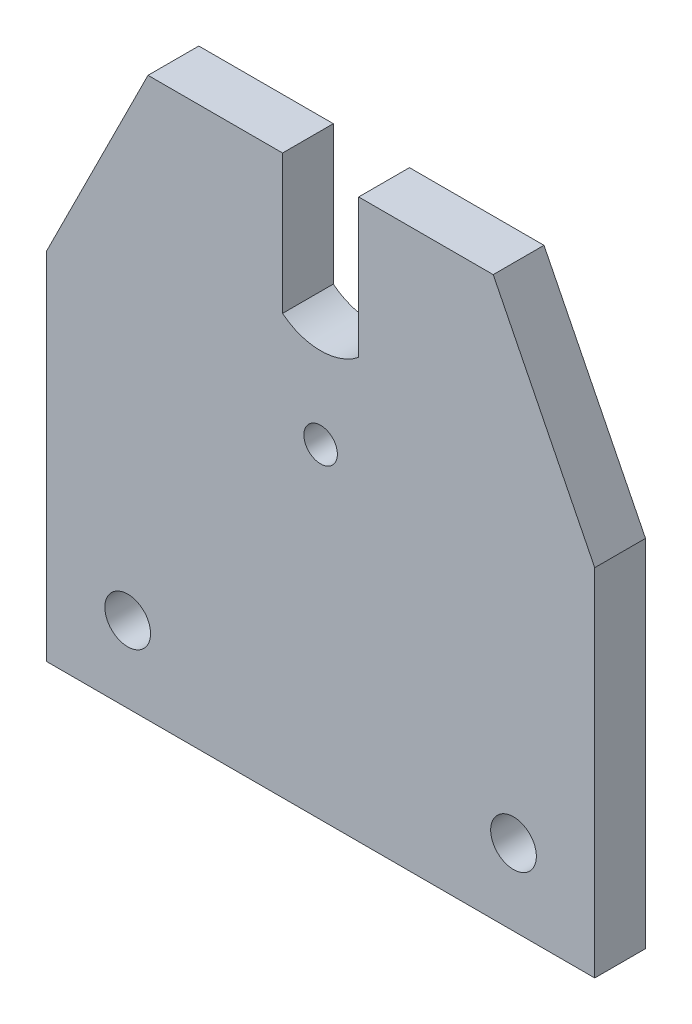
from build123d import *

# Parameters (mm, degrees)
SKETCH_1_R      = 2.25
SKETCH_1_R_2    = 1.65
EXTRUDE_1_DEPTH = 5


with BuildPart() as part:
    # Sketch 1 → Extrude 1 (new body)
    with BuildSketch(Plane.XY):
        with BuildLine():
            Line((0, 0), (54, 0))
            Line((54, 0), (54, 35))
            Line((54, 35), (44, 55))
            Line((44, 55), (30.75, 55))
            Line((30.75, 55), (30.75, 41.316251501))
            ThreePointArc((30.75, 41.316251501), (27, 40), (23.25, 41.316251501))
            Line((23.25, 41.316251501), (23.25, 55))
            Line((23.25, 55), (10, 55))
            Line((10, 55), (0, 35))
            Line((0, 35), (0, 0))
        make_face()
        with Locations((8, 7.5)):
            Circle(SKETCH_1_R, mode=Mode.SUBTRACT)
        with Locations((46, 7.5)):
            Circle(SKETCH_1_R, mode=Mode.SUBTRACT)
        with Locations((27, 32)):
            Circle(SKETCH_1_R_2, mode=Mode.SUBTRACT)
    extrude(amount=EXTRUDE_1_DEPTH)


solid = part.part
